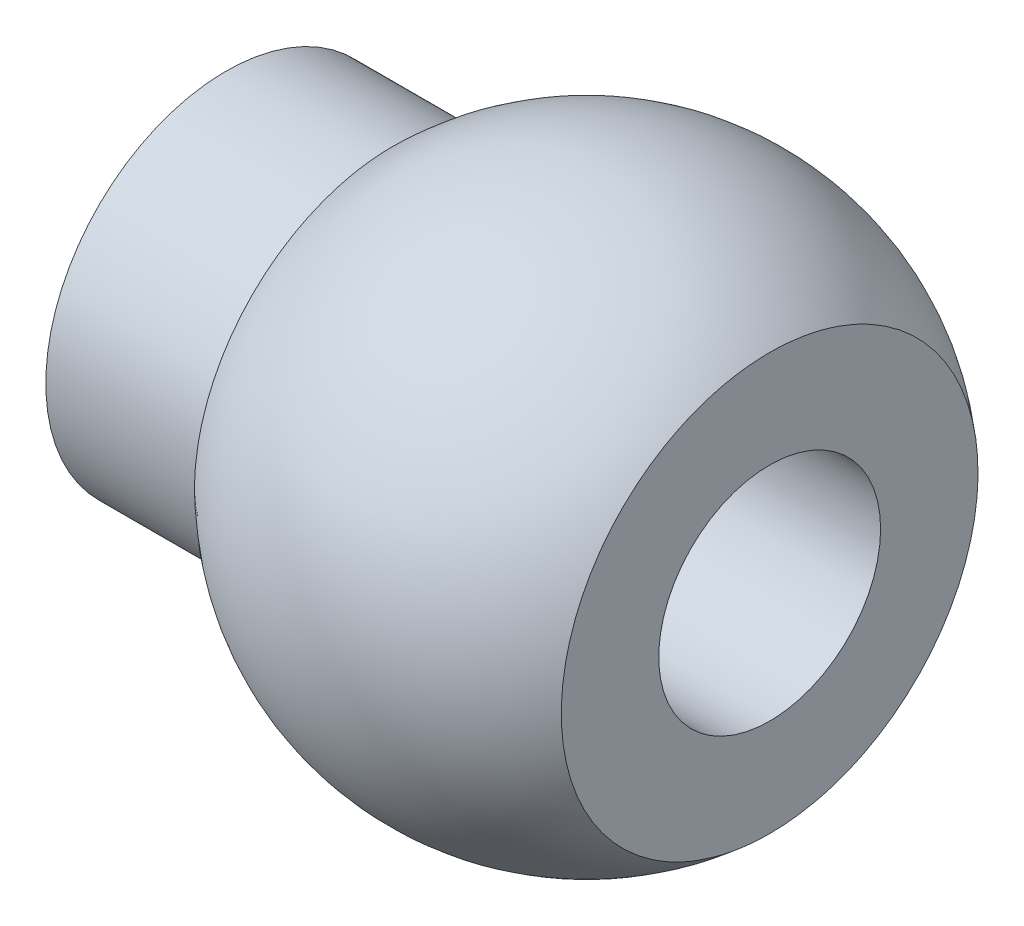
ISO-10303-21;
HEADER;
FILE_DESCRIPTION(('STEP AP214'),'2;1');
FILE_NAME('part.step','',(''),(''),'','','');
FILE_SCHEMA(('AUTOMOTIVE_DESIGN { 1 0 10303 214 1 1 1 1 }'));
ENDSEC;
DATA;
#1=APPLICATION_CONTEXT('core data for automotive mechanical design processes');
#2=APPLICATION_PROTOCOL_DEFINITION('international standard','automotive_design',2000,#1);
#3=PRODUCT_CONTEXT('',#1,'mechanical');
#4=PRODUCT('Part','Part','',(#3));
#5=PRODUCT_RELATED_PRODUCT_CATEGORY('part','',(#4));
#6=PRODUCT_DEFINITION_FORMATION('','',#4);
#7=PRODUCT_DEFINITION_CONTEXT('part definition',#1,'design');
#8=PRODUCT_DEFINITION('design','',#6,#7);
#9=PRODUCT_DEFINITION_SHAPE('','',#8);
#10=(LENGTH_UNIT() NAMED_UNIT(*) SI_UNIT(.MILLI.,.METRE.));
#11=(NAMED_UNIT(*) PLANE_ANGLE_UNIT() SI_UNIT($,.RADIAN.));
#12=(NAMED_UNIT(*) SI_UNIT($,.STERADIAN.) SOLID_ANGLE_UNIT());
#13=UNCERTAINTY_MEASURE_WITH_UNIT(LENGTH_MEASURE(1.E-05),#10,'distance_accuracy_value','');
#14=(GEOMETRIC_REPRESENTATION_CONTEXT(3) GLOBAL_UNCERTAINTY_ASSIGNED_CONTEXT((#13)) GLOBAL_UNIT_ASSIGNED_CONTEXT((#10,
#11,#12)) REPRESENTATION_CONTEXT('',''));
#15=CARTESIAN_POINT('',(0.,0.,0.));
#16=DIRECTION('',(0.,0.,1.));
#17=DIRECTION('',(1.,0.,0.));
#18=AXIS2_PLACEMENT_3D('',#15,#16,#17);
#19=CARTESIAN_POINT('',(-6.5,0.,0.));
#20=DIRECTION('',(1.,0.,0.));
#21=DIRECTION('',(0.,0.,-1.));
#22=AXIS2_PLACEMENT_3D('',#19,#20,#21);
#23=PLANE('',#22);
#24=CARTESIAN_POINT('',(-6.5,0.,0.));
#25=DIRECTION('',(1.,0.,0.));
#26=DIRECTION('',(0.,0.,-1.));
#27=AXIS2_PLACEMENT_3D('',#24,#25,#26);
#28=CIRCLE('',#27,2.);
#29=CARTESIAN_POINT('',(-6.5,0.,-2.));
#30=VERTEX_POINT('',#29);
#31=EDGE_CURVE('E74',#30,#30,#28,.T.);
#32=ORIENTED_EDGE('',*,*,#31,.T.);
#33=EDGE_LOOP('',(#32));
#34=FACE_BOUND('',#33,.T.);
#35=CARTESIAN_POINT('',(-6.5,0.,0.));
#36=DIRECTION('',(1.,0.,0.));
#37=DIRECTION('',(0.,0.,-1.));
#38=AXIS2_PLACEMENT_3D('',#35,#36,#37);
#39=CIRCLE('',#38,3.25);
#40=CARTESIAN_POINT('',(-6.5,0.,-3.25));
#41=VERTEX_POINT('',#40);
#42=EDGE_CURVE('E22',#41,#41,#39,.T.);
#43=ORIENTED_EDGE('',*,*,#42,.F.);
#44=EDGE_LOOP('',(#43));
#45=FACE_BOUND('',#44,.T.);
#46=ADVANCED_FACE('F16',(#34,#45),#23,.F.);
#47=CARTESIAN_POINT('',(-6.99,0.,0.));
#48=DIRECTION('',(1.,0.,0.));
#49=DIRECTION('',(0.,0.,-1.));
#50=AXIS2_PLACEMENT_3D('',#47,#48,#49);
#51=CYLINDRICAL_SURFACE('',#50,3.25);
#52=ORIENTED_EDGE('',*,*,#42,.T.);
#53=EDGE_LOOP('',(#52));
#54=FACE_BOUND('',#53,.T.);
#55=CARTESIAN_POINT('',(-3.5,0.,0.));
#56=DIRECTION('',(1.,0.,0.));
#57=DIRECTION('',(0.,0.,-1.));
#58=AXIS2_PLACEMENT_3D('',#55,#56,#57);
#59=CIRCLE('',#58,3.25);
#60=CARTESIAN_POINT('',(-3.5,0.,-3.25));
#61=VERTEX_POINT('',#60);
#62=EDGE_CURVE('E45',#61,#61,#59,.F.);
#63=ORIENTED_EDGE('',*,*,#62,.T.);
#64=EDGE_LOOP('',(#63));
#65=FACE_BOUND('',#64,.T.);
#66=ADVANCED_FACE('F71',(#54,#65),#51,.T.);
#67=CARTESIAN_POINT('',(-7.48,0.,0.));
#68=DIRECTION('',(1.,0.,0.));
#69=DIRECTION('',(0.,0.,-1.));
#70=AXIS2_PLACEMENT_3D('',#67,#68,#69);
#71=CYLINDRICAL_SURFACE('',#70,2.);
#72=CARTESIAN_POINT('',(3.3,0.,0.));
#73=DIRECTION('',(1.,0.,0.));
#74=DIRECTION('',(0.,0.,-1.));
#75=AXIS2_PLACEMENT_3D('',#72,#73,#74);
#76=CIRCLE('',#75,2.);
#77=CARTESIAN_POINT('',(3.3,0.,-2.));
#78=VERTEX_POINT('',#77);
#79=EDGE_CURVE('E42',#78,#78,#76,.F.);
#80=ORIENTED_EDGE('',*,*,#79,.F.);
#81=EDGE_LOOP('',(#80));
#82=FACE_BOUND('',#81,.T.);
#83=ORIENTED_EDGE('',*,*,#31,.F.);
#84=EDGE_LOOP('',(#83));
#85=FACE_BOUND('',#84,.T.);
#86=ADVANCED_FACE('F57',(#82,#85),#71,.F.);
#87=CARTESIAN_POINT('',(-3.5,0.,0.));
#88=DIRECTION('',(1.,0.,0.));
#89=DIRECTION('',(0.,0.,-1.));
#90=AXIS2_PLACEMENT_3D('',#87,#88,#89);
#91=PLANE('',#90);
#92=ORIENTED_EDGE('',*,*,#62,.F.);
#93=EDGE_LOOP('',(#92));
#94=FACE_BOUND('',#93,.T.);
#95=CARTESIAN_POINT('',(-3.5,3.57071421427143,0.));
#96=CARTESIAN_POINT('',(-3.5,3.57070609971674,0.200603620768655));
#97=CARTESIAN_POINT('',(-3.5,3.55375519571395,0.401327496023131));
#98=CARTESIAN_POINT('',(-3.5,3.48637881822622,0.797218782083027));
#99=CARTESIAN_POINT('',(-3.5,3.43591986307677,0.992380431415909));
#100=CARTESIAN_POINT('',(-3.5,3.30296408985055,1.37139686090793));
#101=CARTESIAN_POINT('',(-3.5,3.22048003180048,1.55525611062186));
#102=CARTESIAN_POINT('',(-3.5,3.02583243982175,1.9064747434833));
#103=CARTESIAN_POINT('',(-3.5,2.91367495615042,2.07383748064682));
#104=CARTESIAN_POINT('',(-3.5,2.66284573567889,2.387375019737));
#105=CARTESIAN_POINT('',(-3.5,2.5241717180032,2.53354799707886));
#106=CARTESIAN_POINT('',(-3.5,2.2242471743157,2.80054218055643));
#107=CARTESIAN_POINT('',(-3.49999999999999,2.06299593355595,2.92136258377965));
#108=CARTESIAN_POINT('',(-3.50000000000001,1.72250042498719,3.13421478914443));
#109=CARTESIAN_POINT('',(-3.50000000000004,1.54325642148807,3.22624701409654));
#110=CARTESIAN_POINT('',(-3.49999999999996,1.17186203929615,3.37891246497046));
#111=CARTESIAN_POINT('',(-3.49999999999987,0.979711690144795,3.43954576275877));
#112=CARTESIAN_POINT('',(-3.49999999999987,0.587958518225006,3.52769257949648));
#113=CARTESIAN_POINT('',(-3.49999999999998,0.388355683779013,3.55520604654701));
#114=CARTESIAN_POINT('',(-3.50000000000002,-0.012635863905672,3.5763319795));
#115=CARTESIAN_POINT('',(-3.49999999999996,-0.214024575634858,3.56994447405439));
#116=CARTESIAN_POINT('',(-3.49999999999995,-0.612870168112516,3.52344999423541));
#117=CARTESIAN_POINT('',(-3.5,-0.810327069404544,3.48334319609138));
#118=CARTESIAN_POINT('',(-3.5,-1.1957071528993,3.37054815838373));
#119=CARTESIAN_POINT('',(-3.49999999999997,-1.3836302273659,3.29785955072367));
#120=CARTESIAN_POINT('',(-3.49999999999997,-1.74461226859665,3.12196123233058));
#121=CARTESIAN_POINT('',(-3.5,-1.9176706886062,3.01875039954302));
#122=CARTESIAN_POINT('',(-3.5,-2.24398880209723,2.78474770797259));
#123=CARTESIAN_POINT('',(-3.49999999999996,-2.39725017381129,2.6539581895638));
#124=CARTESIAN_POINT('',(-3.49999999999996,-2.67961506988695,2.36853514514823));
#125=CARTESIAN_POINT('',(-3.49999999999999,-2.80872300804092,2.21390598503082));
#126=CARTESIAN_POINT('',(-3.50000000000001,-3.03920517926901,1.88508607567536));
#127=CARTESIAN_POINT('',(-3.5,-3.14056688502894,1.71088654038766));
#128=CARTESIAN_POINT('',(-3.5,-3.31266491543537,1.34783858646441));
#129=CARTESIAN_POINT('',(-3.5,-3.38337751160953,1.15897895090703));
#130=CARTESIAN_POINT('',(-3.5,-3.49195197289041,0.772301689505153));
#131=CARTESIAN_POINT('',(-3.5,-3.52987908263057,0.574502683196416));
#132=CARTESIAN_POINT('',(-3.5,-3.55753627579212,0.312866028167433));
#133=CARTESIAN_POINT('',(-3.5,-3.56247635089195,0.25038513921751));
#134=CARTESIAN_POINT('',(-3.5,-3.56906489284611,0.125273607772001));
#135=CARTESIAN_POINT('',(-3.5,-3.57071497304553,0.0626430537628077));
#136=CARTESIAN_POINT('',(-3.5,-3.57071269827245,-0.125158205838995));
#137=CARTESIAN_POINT('',(-3.5,-3.56412130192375,-0.250366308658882));
#138=CARTESIAN_POINT('',(-3.5,-3.5378372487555,-0.499423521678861));
#139=CARTESIAN_POINT('',(-3.5,-3.51813631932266,-0.623271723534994));
#140=CARTESIAN_POINT('',(-3.5,-3.45005034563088,-0.941970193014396));
#141=CARTESIAN_POINT('',(-3.5,-3.3915421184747,-1.13475821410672));
#142=CARTESIAN_POINT('',(-3.5,-3.24295799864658,-1.50785570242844));
#143=CARTESIAN_POINT('',(-3.5,-3.15285545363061,-1.6881544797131));
#144=CARTESIAN_POINT('',(-3.5,-2.94367767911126,-2.03102335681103));
#145=CARTESIAN_POINT('',(-3.50000000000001,-2.8246119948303,-2.19359927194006));
#146=CARTESIAN_POINT('',(-3.49999999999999,-2.5609002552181,-2.49641755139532));
#147=CARTESIAN_POINT('',(-3.49999999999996,-2.41625898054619,-2.63666408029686));
#148=CARTESIAN_POINT('',(-3.49999999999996,-2.10547344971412,-2.89089739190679));
#149=CARTESIAN_POINT('',(-3.49999999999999,-1.93932754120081,-3.00488215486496));
#150=CARTESIAN_POINT('',(-3.50000000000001,-1.59025207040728,-3.2033436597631));
#151=CARTESIAN_POINT('',(-3.5,-1.40732195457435,-3.28781942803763));
#152=CARTESIAN_POINT('',(-3.5,-1.02987863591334,-3.42485911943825));
#153=CARTESIAN_POINT('',(-3.5,-0.835365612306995,-3.47742353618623));
#154=CARTESIAN_POINT('',(-3.5,-0.440275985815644,-3.54915020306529));
#155=CARTESIAN_POINT('',(-3.5,-0.239699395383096,-3.56831252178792));
#156=CARTESIAN_POINT('',(-3.5,0.161824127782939,-3.57269129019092));
#157=CARTESIAN_POINT('',(-3.5,0.362771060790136,-3.55790771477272));
#158=CARTESIAN_POINT('',(-3.5,0.759330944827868,-3.49481424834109));
#159=CARTESIAN_POINT('',(-3.5,0.954943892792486,-3.44650433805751));
#160=CARTESIAN_POINT('',(-3.5,1.33528566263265,-3.31772869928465));
#161=CARTESIAN_POINT('',(-3.5,1.52001432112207,-3.2372624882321));
#162=CARTESIAN_POINT('',(-3.5,1.87333489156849,-3.04646101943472));
#163=CARTESIAN_POINT('',(-3.5,2.04192729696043,-2.93612667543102));
#164=CARTESIAN_POINT('',(-3.5,2.35818217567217,-2.68873213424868));
#165=CARTESIAN_POINT('',(-3.5,2.50584645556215,-2.55167424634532));
#166=CARTESIAN_POINT('',(-3.5,2.77609973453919,-2.25468034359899));
#167=CARTESIAN_POINT('',(-3.49999999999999,2.89868362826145,-2.0947396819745));
#168=CARTESIAN_POINT('',(-3.5,3.1152985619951,-1.75649625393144));
#169=CARTESIAN_POINT('',(-3.5,3.2093182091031,-1.57818619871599));
#170=CARTESIAN_POINT('',(-3.5,3.36599778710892,-1.20842817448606));
#171=CARTESIAN_POINT('',(-3.49999999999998,3.42868897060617,-1.01699351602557));
#172=CARTESIAN_POINT('',(-3.49999999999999,3.50668476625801,-0.687249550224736));
#173=CARTESIAN_POINT('',(-3.5,3.53066207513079,-0.550926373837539));
#174=CARTESIAN_POINT('',(-3.5,3.56267959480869,-0.276421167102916));
#175=CARTESIAN_POINT('',(-3.5,3.57071980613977,-0.138239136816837));
#176=CARTESIAN_POINT('',(-3.5,3.57071421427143,0.));
#177=B_SPLINE_CURVE_WITH_KNOTS('',3,(#95,#96,#97,#98,#99,#100,#101,#102,#103,#104,#105,#106,
#107,#108,#109,#110,#111,#112,#113,#114,#115,#116,#117,#118,#119,#120,#121,#122,#123,#124,#125,
#126,#127,#128,#129,#130,#131,#132,#133,#134,#135,#136,#137,#138,#139,#140,#141,#142,#143,#144,
#145,#146,#147,#148,#149,#150,#151,#152,#153,#154,#155,#156,#157,#158,#159,#160,#161,#162,#163,
#164,#165,#166,#167,#168,#169,#170,#171,#172,#173,#174,#175,#176),.UNSPECIFIED.,.T.,.F.,(4,2,2,
2,2,2,2,2,2,2,2,2,2,2,2,2,2,2,2,2,2,2,2,2,2,2,2,2,2,2,2,2,2,2,2,2,2,2,2,2,4),(0.,
0.601309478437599,1.20322069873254,1.80489234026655,2.40644139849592,3.00804222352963,
3.60966209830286,4.2112731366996,4.81288279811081,5.41449340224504,6.01610349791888,
6.61771044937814,7.21932419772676,7.82096006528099,8.42254489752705,9.02401968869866,
9.62576559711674,10.2279765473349,10.8289862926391,11.0169575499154,11.2048366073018,
11.5802111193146,11.9558227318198,12.5571788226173,13.1590434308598,13.7607099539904,
14.3622641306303,14.9638645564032,15.5654848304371,16.1670957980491,16.7687055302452,
17.3703157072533,17.9719262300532,18.5735457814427,19.1751469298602,19.7766961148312,
20.3783676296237,20.9802788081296,21.5815883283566,21.9959602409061,22.4103321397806),.UNSPECIFIED.);
#178=CARTESIAN_POINT('',(-3.5,3.57071421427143,0.));
#179=VERTEX_POINT('',#178);
#180=EDGE_CURVE('E28',#179,#179,#177,.T.);
#181=ORIENTED_EDGE('',*,*,#180,.F.);
#182=EDGE_LOOP('',(#181));
#183=FACE_BOUND('',#182,.T.);
#184=ADVANCED_FACE('F53',(#94,#183),#91,.F.);
#185=CARTESIAN_POINT('',(3.3,0.,0.));
#186=DIRECTION('',(1.,0.,0.));
#187=DIRECTION('',(0.,0.,-1.));
#188=AXIS2_PLACEMENT_3D('',#185,#186,#187);
#189=PLANE('',#188);
#190=ORIENTED_EDGE('',*,*,#79,.T.);
#191=EDGE_LOOP('',(#190));
#192=FACE_BOUND('',#191,.T.);
#193=CARTESIAN_POINT('',(3.3,-3.75632799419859,0.));
#194=CARTESIAN_POINT('',(3.3,-3.75631798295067,0.210931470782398));
#195=CARTESIAN_POINT('',(3.3,-3.73849688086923,0.422062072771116));
#196=CARTESIAN_POINT('',(3.3,-3.66763814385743,0.838558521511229));
#197=CARTESIAN_POINT('',(3.3,-3.61454600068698,1.04391493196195));
#198=CARTESIAN_POINT('',(3.3,-3.47465515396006,1.44269461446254));
#199=CARTESIAN_POINT('',(3.3,-3.38787701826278,1.63612508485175));
#200=CARTESIAN_POINT('',(3.3,-3.18310741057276,2.00560028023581));
#201=CARTESIAN_POINT('',(3.3,-3.06512617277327,2.18165067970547));
#202=CARTESIAN_POINT('',(3.3,-2.80126801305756,2.51147399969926));
#203=CARTESIAN_POINT('',(3.3,-2.65538729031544,2.66524387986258));
#204=CARTESIAN_POINT('',(3.3,-2.33987252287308,2.94611775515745));
#205=CARTESIAN_POINT('',(3.3,-2.17023717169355,3.07322028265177));
#206=CARTESIAN_POINT('',(3.3,-1.8120396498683,3.29713852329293));
#207=CARTESIAN_POINT('',(3.30000000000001,-1.62347794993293,3.39395498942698));
#208=CARTESIAN_POINT('',(3.29999999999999,-1.23277731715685,3.55455606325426));
#209=CARTESIAN_POINT('',(3.29999999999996,-1.03063845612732,3.61834084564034));
#210=CARTESIAN_POINT('',(3.29999999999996,-0.618522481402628,3.71107033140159));
#211=CARTESIAN_POINT('',(3.29999999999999,-0.408545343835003,3.74001492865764));
#212=CARTESIAN_POINT('',(3.30000000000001,0.013294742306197,3.76223653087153));
#213=CARTESIAN_POINT('',(3.29999999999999,0.225157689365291,3.75551356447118));
#214=CARTESIAN_POINT('',(3.29999999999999,0.64472091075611,3.70661154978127));
#215=CARTESIAN_POINT('',(3.3,0.852421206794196,3.66443268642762));
#216=CARTESIAN_POINT('',(3.3,1.25789122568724,3.54573939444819));
#217=CARTESIAN_POINT('',(3.29999999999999,1.45566083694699,3.46922458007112));
#218=CARTESIAN_POINT('',(3.29999999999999,1.74040502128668,3.33049520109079));
#219=CARTESIAN_POINT('',(3.3,1.83338002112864,3.28022678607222));
#220=CARTESIAN_POINT('',(3.3,2.01476988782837,3.17203965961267));
#221=CARTESIAN_POINT('',(3.3,2.10318580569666,3.11412272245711));
#222=CARTESIAN_POINT('',(3.3,2.27478236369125,2.99107135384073));
#223=CARTESIAN_POINT('',(3.3,2.35796535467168,2.92594020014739));
#224=CARTESIAN_POINT('',(3.3,2.51861653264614,2.78886068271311));
#225=CARTESIAN_POINT('',(3.29999999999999,2.59607912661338,2.71690580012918));
#226=CARTESIAN_POINT('',(3.29999999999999,2.81884621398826,2.49170464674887));
#227=CARTESIAN_POINT('',(3.3,2.9547574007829,2.32895847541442));
#228=CARTESIAN_POINT('',(3.3,3.19727829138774,1.98293865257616));
#229=CARTESIAN_POINT('',(3.3,3.30388912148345,1.79966579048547));
#230=CARTESIAN_POINT('',(3.3,3.43962323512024,1.51334707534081));
#231=CARTESIAN_POINT('',(3.3,3.48087165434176,1.41588511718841));
#232=CARTESIAN_POINT('',(3.3,3.55498313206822,1.21788546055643));
#233=CARTESIAN_POINT('',(3.3,3.58785296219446,1.1173503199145));
#234=CARTESIAN_POINT('',(3.3,3.64495399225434,0.914029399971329));
#235=CARTESIAN_POINT('',(3.3,3.66919815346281,0.811247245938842));
#236=CARTESIAN_POINT('',(3.3,3.70894507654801,0.604027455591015));
#237=CARTESIAN_POINT('',(3.3,3.72445047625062,0.499590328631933));
#238=CARTESIAN_POINT('',(3.3,3.7424601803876,0.329148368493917));
#239=CARTESIAN_POINT('',(3.3,3.74765943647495,0.263417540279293));
#240=CARTESIAN_POINT('',(3.3,3.75459386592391,0.131798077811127));
#241=CARTESIAN_POINT('',(3.3,3.75632996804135,0.0659094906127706));
#242=CARTESIAN_POINT('',(3.3,3.75632294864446,-0.168478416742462));
#243=CARTESIAN_POINT('',(3.3,3.74496096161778,-0.337093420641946));
#244=CARTESIAN_POINT('',(3.3,3.69968838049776,-0.67146814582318));
#245=CARTESIAN_POINT('',(3.3,3.66573847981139,-0.837222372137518));
#246=CARTESIAN_POINT('',(3.3,3.56455738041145,-1.20350702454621));
#247=CARTESIAN_POINT('',(3.3,3.49112422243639,-1.40236151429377));
#248=CARTESIAN_POINT('',(3.3,3.31190996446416,-1.78491410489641));
#249=CARTESIAN_POINT('',(3.29999999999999,3.20612133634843,-1.96860866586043));
#250=CARTESIAN_POINT('',(3.30000000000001,2.96521024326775,-2.31562598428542));
#251=CARTESIAN_POINT('',(3.30000000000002,2.83009038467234,-2.47895054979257));
#252=CARTESIAN_POINT('',(3.29999999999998,2.53435703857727,-2.78058401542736));
#253=CARTESIAN_POINT('',(3.29999999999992,2.37374495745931,-2.91889429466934));
#254=CARTESIAN_POINT('',(3.29999999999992,2.03157654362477,-3.16659192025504));
#255=CARTESIAN_POINT('',(3.29999999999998,1.85001973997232,-3.27597861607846));
#256=CARTESIAN_POINT('',(3.30000000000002,1.47111680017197,-3.46271948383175));
#257=CARTESIAN_POINT('',(3.30000000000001,1.27377050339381,-3.54007332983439));
#258=CARTESIAN_POINT('',(3.29999999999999,0.868893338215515,-3.66055106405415));
#259=CARTESIAN_POINT('',(3.3,0.661362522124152,-3.70367512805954));
#260=CARTESIAN_POINT('',(3.3,0.242006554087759,-3.75446970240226));
#261=CARTESIAN_POINT('',(3.3,0.0301814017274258,-3.7621402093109));
#262=CARTESIAN_POINT('',(3.3,-0.391749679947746,-3.74180997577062));
#263=CARTESIAN_POINT('',(3.3,-0.601855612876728,-3.71380931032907));
#264=CARTESIAN_POINT('',(3.3,-1.01438529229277,-3.62293147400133));
#265=CARTESIAN_POINT('',(3.3,-1.21680900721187,-3.56005415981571));
#266=CARTESIAN_POINT('',(3.3,-1.60823202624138,-3.40120601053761));
#267=CARTESIAN_POINT('',(3.3,-1.79723099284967,-3.30523434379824));
#268=CARTESIAN_POINT('',(3.3,-2.15642376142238,-3.08292768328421));
#269=CARTESIAN_POINT('',(3.3,-2.32661858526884,-2.95659434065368));
#270=CARTESIAN_POINT('',(3.3,-2.6433619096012,-2.67716939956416));
#271=CARTESIAN_POINT('',(3.3,-2.78991363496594,-2.52408145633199));
#272=CARTESIAN_POINT('',(3.3,-3.05528450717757,-2.1954162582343));
#273=CARTESIAN_POINT('',(3.3,-3.17409455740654,-2.01983165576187));
#274=CARTESIAN_POINT('',(3.3,-3.380606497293,-1.65112109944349));
#275=CARTESIAN_POINT('',(3.3,-3.46828936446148,-1.45798450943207));
#276=CARTESIAN_POINT('',(3.3,-3.60985449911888,-1.05992727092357));
#277=CARTESIAN_POINT('',(3.29999999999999,-3.66378883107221,-0.855025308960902));
#278=CARTESIAN_POINT('',(3.3,-3.71883635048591,-0.540422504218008));
#279=CARTESIAN_POINT('',(3.3,-3.73288147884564,-0.432835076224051));
#280=CARTESIAN_POINT('',(3.3,-3.75162987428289,-0.216849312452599));
#281=CARTESIAN_POINT('',(3.3,-3.75633314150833,-0.108450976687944));
#282=CARTESIAN_POINT('',(3.3,-3.75632799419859,0.));
#283=B_SPLINE_CURVE_WITH_KNOTS('',3,(#193,#194,#195,#196,#197,#198,#199,#200,#201,#202,#203,
#204,#205,#206,#207,#208,#209,#210,#211,#212,#213,#214,#215,#216,#217,#218,#219,#220,#221,#222,
#223,#224,#225,#226,#227,#228,#229,#230,#231,#232,#233,#234,#235,#236,#237,#238,#239,#240,#241,
#242,#243,#244,#245,#246,#247,#248,#249,#250,#251,#252,#253,#254,#255,#256,#257,#258,#259,#260,
#261,#262,#263,#264,#265,#266,#267,#268,#269,#270,#271,#272,#273,#274,#275,#276,#277,#278,#279,
#280,#281,#282),.UNSPECIFIED.,.T.,.F.,(4,2,2,2,2,2,2,2,2,2,2,2,2,2,2,2,2,2,2,2,2,2,2,2,2,2,2,2,
2,2,2,2,2,2,2,2,2,2,2,2,2,2,2,2,4),(0.,0.632393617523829,1.26576682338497,1.89875391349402,
2.53153364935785,3.1643996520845,3.79730047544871,4.43018556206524,5.06306730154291,
5.69595096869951,6.32883412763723,6.96171398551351,7.59460095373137,7.91137453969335,
8.22807476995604,8.54463169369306,8.86149413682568,9.49438971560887,10.1272609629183,
10.4444401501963,10.7613621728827,11.0778059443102,11.394154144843,11.5918745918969,
11.7895420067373,12.2948211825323,12.8009819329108,13.4337916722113,14.0667487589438,
14.6996496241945,15.3325155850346,15.9653957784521,16.5982824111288,17.2311657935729,
17.8640492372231,18.4969313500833,19.1298160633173,19.7627166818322,20.3955828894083,
21.0283627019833,21.6613497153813,22.2947228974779,22.9271165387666,23.2522634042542,
23.5774102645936),.UNSPECIFIED.);
#284=CARTESIAN_POINT('',(3.3,-3.75632799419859,0.));
#285=VERTEX_POINT('',#284);
#286=EDGE_CURVE('E11',#285,#285,#283,.T.);
#287=ORIENTED_EDGE('',*,*,#286,.F.);
#288=EDGE_LOOP('',(#287));
#289=FACE_BOUND('',#288,.T.);
#290=ADVANCED_FACE('F36',(#192,#289),#189,.T.);
#291=CARTESIAN_POINT('',(0.,0.,0.));
#292=DIRECTION('',(0.,-1.,0.));
#293=DIRECTION('',(0.,0.,-1.));
#294=AXIS2_PLACEMENT_3D('',#291,#292,#293);
#295=SPHERICAL_SURFACE('',#294,5.);
#296=CARTESIAN_POINT('',(0.,-5.,0.));
#297=VERTEX_POINT('',#296);
#298=VERTEX_LOOP('',#297);
#299=FACE_BOUND('',#298,.T.);
#300=ORIENTED_EDGE('',*,*,#286,.T.);
#301=EDGE_LOOP('',(#300));
#302=FACE_BOUND('',#301,.T.);
#303=CARTESIAN_POINT('',(0.,5.,0.));
#304=VERTEX_POINT('',#303);
#305=VERTEX_LOOP('',#304);
#306=FACE_BOUND('',#305,.T.);
#307=ORIENTED_EDGE('',*,*,#180,.T.);
#308=EDGE_LOOP('',(#307));
#309=FACE_BOUND('',#308,.T.);
#310=ADVANCED_FACE('F18',(#299,#302,#306,#309),#295,.T.);
#311=CLOSED_SHELL('',(#46,#66,#86,#184,#290,#310));
#312=MANIFOLD_SOLID_BREP('B1',#311);
#313=ADVANCED_BREP_SHAPE_REPRESENTATION('',(#18,#312),#14);
#314=SHAPE_DEFINITION_REPRESENTATION(#9,#313);
ENDSEC;
END-ISO-10303-21;
